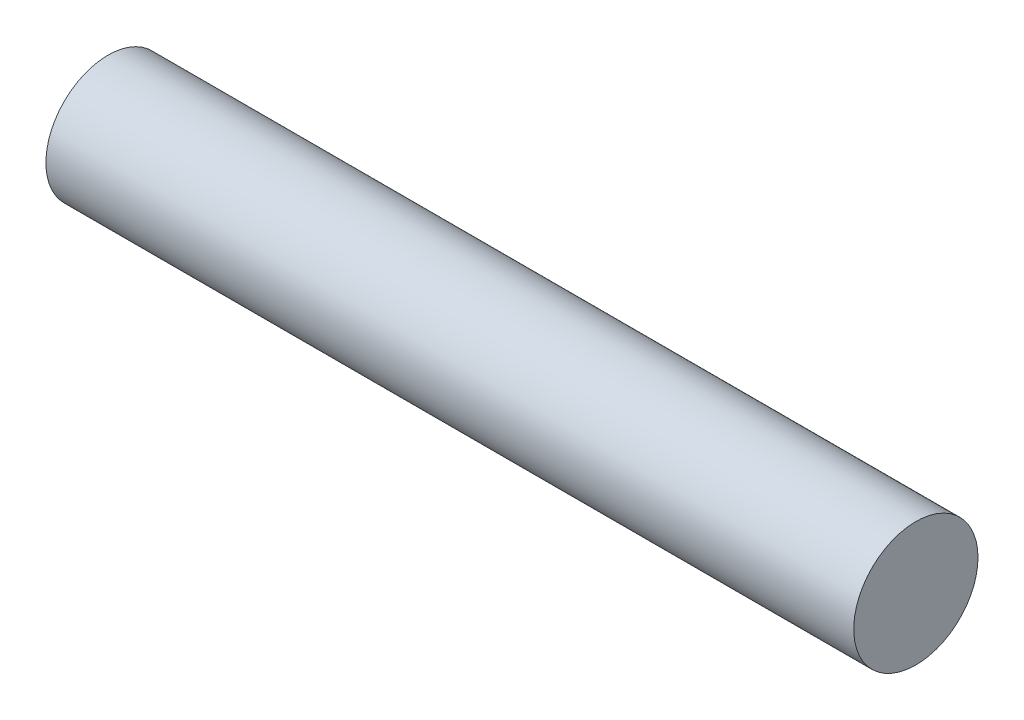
from build123d import *

# Parameters (mm, degrees)
SKETCH_1_R              = 2
F_01_SHAFT_D4_L26_DEPTH = 13


with BuildPart() as part:
    # Sketch 1 → 01_SHAFT_D4_L26 (new, symmetric)
    with BuildSketch(Plane(origin=(0, 0, 0), x_dir=(0, 0, -1), z_dir=(1, 0, 0))):
        Circle(SKETCH_1_R)
    extrude(amount=F_01_SHAFT_D4_L26_DEPTH, both=True)


solid = part.part
